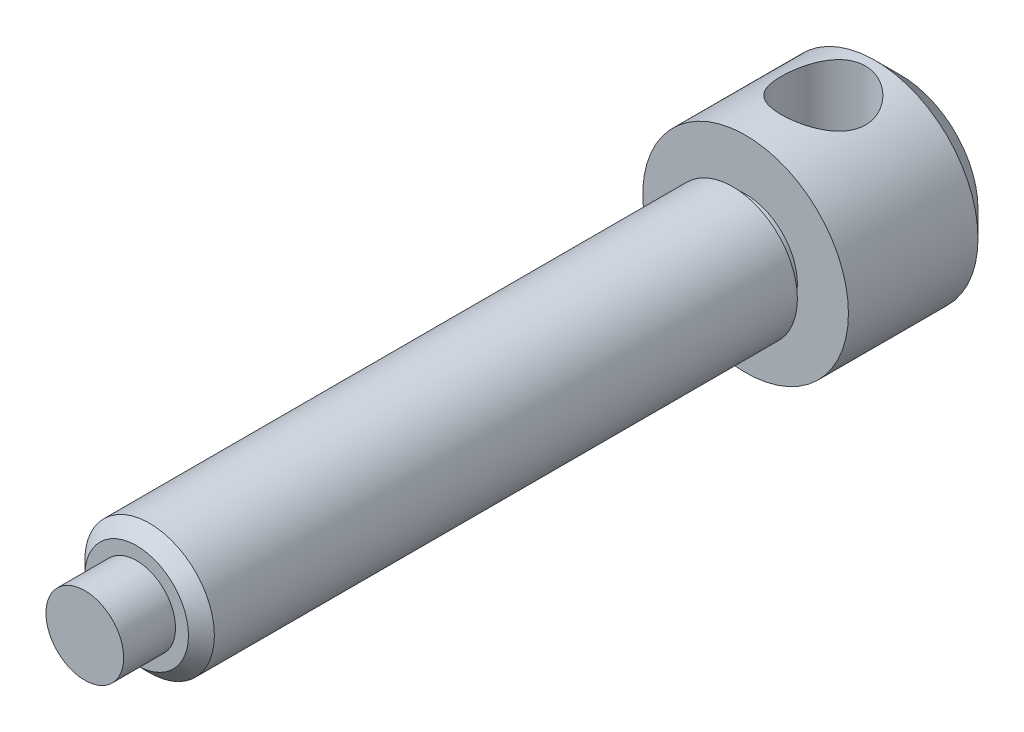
from build123d import *

# Parameters (mm, degrees)
ESBO_O1_R                  = 7.9375
RESSALTO_EXTRUS_O1_DEPTH   = 12
ESBO_O2_R                  = 4
RESSALTO_EXTRUS_O2_DEPTH   = 1
ESBO_O3_R                  = 5
RESSALTO_EXTRUS_O3_DEPTH   = 46
ESBO_O4_R                  = 3
RESSALTO_EXTRUS_O4_DEPTH   = 4
CORTE_EXTRUS_O1_DEPTH      = 64.992248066
CORTE_EXTRUS_O1_DEPTH_BACK = 64.992248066
ESBO_O5_R                  = 3.25
CHANFRO1_SIZE              = 2
CHANFRO2_SIZE              = 1


with BuildPart() as part:
    # Esbo_o1 → Ressalto-extrus_o1 (new body)
    with BuildSketch(Plane.XY):
        Circle(ESBO_O1_R)
    extrude(amount=RESSALTO_EXTRUS_O1_DEPTH)

    # Esbo_o2 → Ressalto-extrus_o2 (add)
    with BuildSketch(Plane.XY.offset(12)):
        Circle(ESBO_O2_R)
    extrude(amount=RESSALTO_EXTRUS_O2_DEPTH)

    # Esbo_o3 → Ressalto-extrus_o3 (add)
    with BuildSketch(Plane.XY.offset(13)):
        Circle(ESBO_O3_R)
    extrude(amount=RESSALTO_EXTRUS_O3_DEPTH)

    # Esbo_o4 → Ressalto-extrus_o4 (add)
    with BuildSketch(Plane.XY.offset(59)):
        Circle(ESBO_O4_R)
    extrude(amount=RESSALTO_EXTRUS_O4_DEPTH)

    # Esbo_o5 → Corte-extrus_o1 (cut, two sides: drawn at the far end of the back side and taken through both)
    with BuildSketch(Plane(origin=(0, 0, 0), x_dir=(1, 0, 0), z_dir=(0, 1, 0)).offset(-CORTE_EXTRUS_O1_DEPTH_BACK)):
        with Locations(Location((0, -6, 0), (0, 0, 270))):
            Circle(ESBO_O5_R)
    extrude(amount=CORTE_EXTRUS_O1_DEPTH + CORTE_EXTRUS_O1_DEPTH_BACK, mode=Mode.SUBTRACT)

    # Chanfro1
    chanfro1_edges = [part.edges().sort_by_distance(p)[0] for p in [
        (-7.9375, 0, 0),
    ]]
    chamfer(chanfro1_edges, length=CHANFRO1_SIZE)

    # Chanfro2
    chanfro2_edges = [part.edges().sort_by_distance(p)[0] for p in [
        (-5, 0, 59),
    ]]
    chamfer(chanfro2_edges, length=CHANFRO2_SIZE)


solid = part.part
